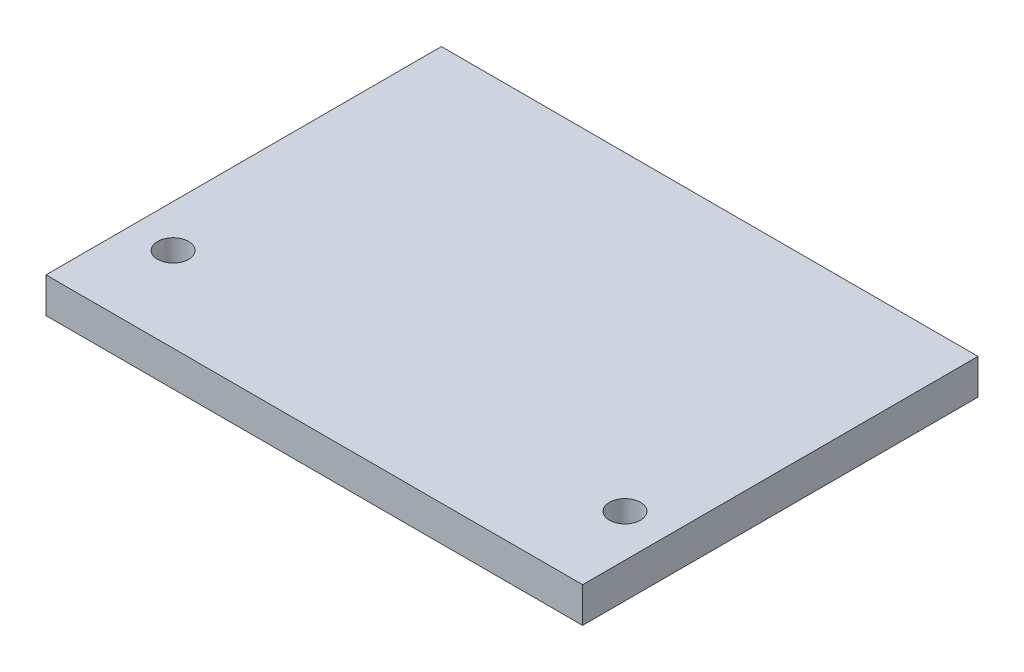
from build123d import *

# Parameters (mm, degrees)
ESQUISSE1_W      = 38
ESQUISSE1_H      = 28
ESQUISSE1_R      = 1.1
EXTRUSION1_DEPTH = 2.5


with BuildPart() as part:
    # Esquisse1 → Extrusion1 (new body)
    with BuildSketch(Plane(origin=(0, 0, 0), x_dir=(1, 0, 0), z_dir=(0, 1, 0))):
        with Locations((19, 14)):
            Rectangle(ESQUISSE1_W, ESQUISSE1_H)
        with Locations(Location((35, 6, 0), (0, 0, 270))):
            Circle(ESQUISSE1_R, mode=Mode.SUBTRACT)
        with Locations(Location((3, 6, 0), (0, 0, 90))):
            Circle(ESQUISSE1_R, mode=Mode.SUBTRACT)
    extrude(amount=EXTRUSION1_DEPTH)


solid = part.part
